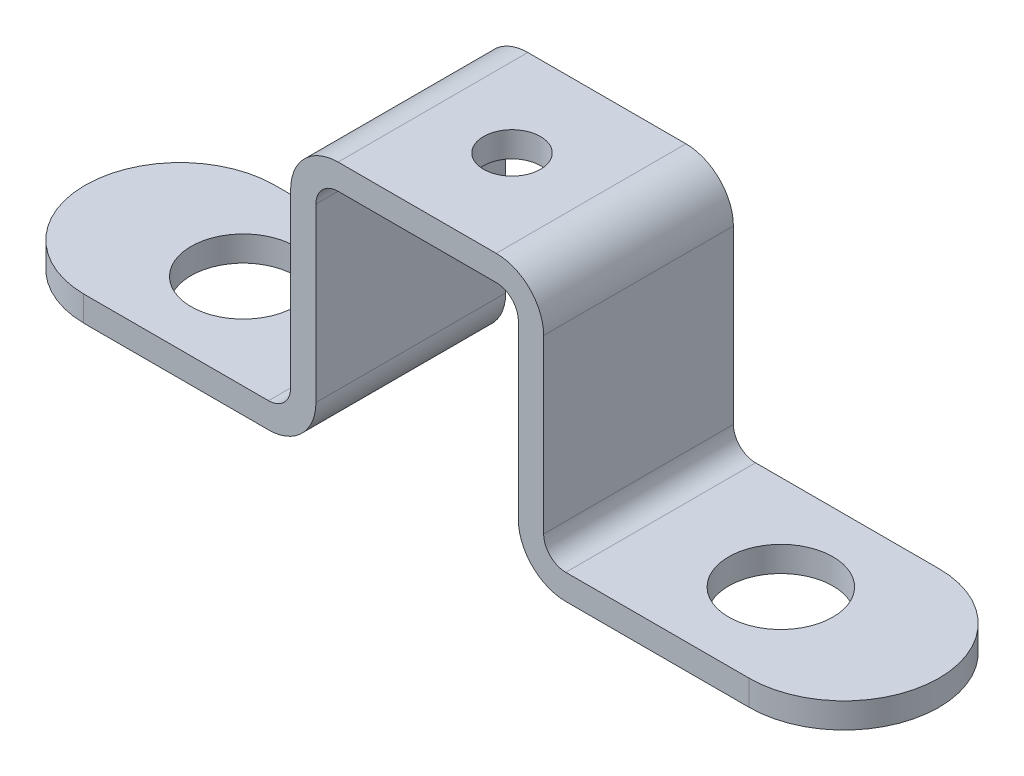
ISO-10303-21;
HEADER;
FILE_DESCRIPTION(('STEP AP214'),'2;1');
FILE_NAME('part.step','',(''),(''),'','','');
FILE_SCHEMA(('AUTOMOTIVE_DESIGN { 1 0 10303 214 1 1 1 1 }'));
ENDSEC;
DATA;
#1=APPLICATION_CONTEXT('core data for automotive mechanical design processes');
#2=APPLICATION_PROTOCOL_DEFINITION('international standard','automotive_design',2000,#1);
#3=PRODUCT_CONTEXT('',#1,'mechanical');
#4=PRODUCT('Part','Part','',(#3));
#5=PRODUCT_RELATED_PRODUCT_CATEGORY('part','',(#4));
#6=PRODUCT_DEFINITION_FORMATION('','',#4);
#7=PRODUCT_DEFINITION_CONTEXT('part definition',#1,'design');
#8=PRODUCT_DEFINITION('design','',#6,#7);
#9=PRODUCT_DEFINITION_SHAPE('','',#8);
#10=(LENGTH_UNIT() NAMED_UNIT(*) SI_UNIT(.MILLI.,.METRE.));
#11=(NAMED_UNIT(*) PLANE_ANGLE_UNIT() SI_UNIT($,.RADIAN.));
#12=(NAMED_UNIT(*) SI_UNIT($,.STERADIAN.) SOLID_ANGLE_UNIT());
#13=UNCERTAINTY_MEASURE_WITH_UNIT(LENGTH_MEASURE(1.E-05),#10,'distance_accuracy_value','');
#14=(GEOMETRIC_REPRESENTATION_CONTEXT(3) GLOBAL_UNCERTAINTY_ASSIGNED_CONTEXT((#13)) GLOBAL_UNIT_ASSIGNED_CONTEXT((#10,
#11,#12)) REPRESENTATION_CONTEXT('',''));
#15=CARTESIAN_POINT('',(0.,0.,0.));
#16=DIRECTION('',(0.,0.,1.));
#17=DIRECTION('',(1.,0.,0.));
#18=AXIS2_PLACEMENT_3D('',#15,#16,#17);
#19=CARTESIAN_POINT('',(-27.,1.6,12.));
#20=DIRECTION('',(0.,-1.,0.));
#21=DIRECTION('',(1.,0.,0.));
#22=AXIS2_PLACEMENT_3D('',#19,#20,#21);
#23=PLANE('',#22);
#24=CARTESIAN_POINT('',(-17.,1.6,6.));
#25=DIRECTION('',(0.,-1.,0.));
#26=DIRECTION('',(1.,0.,0.));
#27=AXIS2_PLACEMENT_3D('',#24,#25,#26);
#28=CIRCLE('',#27,3.3);
#29=CARTESIAN_POINT('',(-13.7,1.6,6.));
#30=VERTEX_POINT('',#29);
#31=EDGE_CURVE('E715',#30,#30,#28,.T.);
#32=ORIENTED_EDGE('',*,*,#31,.T.);
#33=EDGE_LOOP('',(#32));
#34=FACE_BOUND('',#33,.T.);
#35=CARTESIAN_POINT('',(-21.,1.6,6.));
#36=DIRECTION('',(0.,-1.,0.));
#37=DIRECTION('',(1.,0.,0.));
#38=AXIS2_PLACEMENT_3D('',#35,#36,#37);
#39=CIRCLE('',#38,6.00068260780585);
#40=CARTESIAN_POINT('',(-27.,1.6,5.90949165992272));
#41=VERTEX_POINT('',#40);
#42=CARTESIAN_POINT('',(-21.0905083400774,1.6,0.));
#43=VERTEX_POINT('',#42);
#44=EDGE_CURVE('E383',#41,#43,#39,.T.);
#45=ORIENTED_EDGE('',*,*,#44,.F.);
#46=DIRECTION('',(0.,0.,-1.));
#47=VECTOR('',#46,1.);
#48=CARTESIAN_POINT('',(-27.,1.6,12.));
#49=LINE('',#48,#47);
#50=CARTESIAN_POINT('',(-27.,1.6,6.09050834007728));
#51=VERTEX_POINT('',#50);
#52=EDGE_CURVE('E530',#51,#41,#49,.T.);
#53=ORIENTED_EDGE('',*,*,#52,.F.);
#54=CARTESIAN_POINT('',(-21.,1.6,6.));
#55=DIRECTION('',(0.,-1.,0.));
#56=DIRECTION('',(1.,0.,0.));
#57=AXIS2_PLACEMENT_3D('',#54,#55,#56);
#58=CIRCLE('',#57,6.00068260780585);
#59=CARTESIAN_POINT('',(-21.0905083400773,1.6,12.));
#60=VERTEX_POINT('',#59);
#61=EDGE_CURVE('E581',#60,#51,#58,.T.);
#62=ORIENTED_EDGE('',*,*,#61,.F.);
#63=DIRECTION('',(-1.,0.,0.));
#64=VECTOR('',#63,1.);
#65=CARTESIAN_POINT('',(-27.,1.6,12.));
#66=LINE('',#65,#64);
#67=CARTESIAN_POINT('',(-9.4,1.6,12.));
#68=VERTEX_POINT('',#67);
#69=EDGE_CURVE('E586',#68,#60,#66,.T.);
#70=ORIENTED_EDGE('',*,*,#69,.F.);
#71=DIRECTION('',(0.,0.,-1.));
#72=VECTOR('',#71,1.);
#73=CARTESIAN_POINT('',(-9.4,1.6,12.));
#74=LINE('',#73,#72);
#75=CARTESIAN_POINT('',(-9.4,1.6,0.));
#76=VERTEX_POINT('',#75);
#77=EDGE_CURVE('E536',#68,#76,#74,.T.);
#78=ORIENTED_EDGE('',*,*,#77,.T.);
#79=DIRECTION('',(-1.,0.,0.));
#80=VECTOR('',#79,1.);
#81=CARTESIAN_POINT('',(-27.,1.6,0.));
#82=LINE('',#81,#80);
#83=EDGE_CURVE('E687',#76,#43,#82,.T.);
#84=ORIENTED_EDGE('',*,*,#83,.T.);
#85=EDGE_LOOP('',(#45,#53,#62,#70,#78,#84));
#86=FACE_BOUND('',#85,.T.);
#87=ADVANCED_FACE('F368',(#34,#86),#23,.F.);
#88=CARTESIAN_POINT('',(-27.,0.,12.));
#89=DIRECTION('',(1.,0.,0.));
#90=DIRECTION('',(0.,0.,-1.));
#91=AXIS2_PLACEMENT_3D('',#88,#89,#90);
#92=PLANE('',#91);
#93=DIRECTION('',(0.,-1.,0.));
#94=VECTOR('',#93,1.);
#95=CARTESIAN_POINT('',(-27.,16.87,5.90949165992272));
#96=LINE('',#95,#94);
#97=CARTESIAN_POINT('',(-27.,0.,5.90949165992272));
#98=VERTEX_POINT('',#97);
#99=EDGE_CURVE('E517',#41,#98,#96,.T.);
#100=ORIENTED_EDGE('',*,*,#99,.T.);
#101=DIRECTION('',(0.,0.,-1.));
#102=VECTOR('',#101,1.);
#103=CARTESIAN_POINT('',(-27.,0.,12.));
#104=LINE('',#103,#102);
#105=CARTESIAN_POINT('',(-27.,0.,6.09050834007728));
#106=VERTEX_POINT('',#105);
#107=EDGE_CURVE('E528',#106,#98,#104,.T.);
#108=ORIENTED_EDGE('',*,*,#107,.F.);
#109=DIRECTION('',(0.,-1.,0.));
#110=VECTOR('',#109,1.);
#111=CARTESIAN_POINT('',(-27.,16.87,6.09050834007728));
#112=LINE('',#111,#110);
#113=EDGE_CURVE('E588',#51,#106,#112,.T.);
#114=ORIENTED_EDGE('',*,*,#113,.F.);
#115=ORIENTED_EDGE('',*,*,#52,.T.);
#116=EDGE_LOOP('',(#100,#108,#114,#115));
#117=FACE_BOUND('',#116,.T.);
#118=ADVANCED_FACE('F526',(#117),#92,.F.);
#119=CARTESIAN_POINT('',(-9.4,0.,12.));
#120=DIRECTION('',(0.,1.,0.));
#121=DIRECTION('',(0.,0.,1.));
#122=AXIS2_PLACEMENT_3D('',#119,#120,#121);
#123=PLANE('',#122);
#124=CARTESIAN_POINT('',(-17.,0.,6.));
#125=DIRECTION('',(0.,-1.,0.));
#126=DIRECTION('',(0.,0.,-1.));
#127=AXIS2_PLACEMENT_3D('',#124,#125,#126);
#128=CIRCLE('',#127,3.3);
#129=CARTESIAN_POINT('',(-17.,0.,2.7));
#130=VERTEX_POINT('',#129);
#131=EDGE_CURVE('E587',#130,#130,#128,.T.);
#132=ORIENTED_EDGE('',*,*,#131,.F.);
#133=EDGE_LOOP('',(#132));
#134=FACE_BOUND('',#133,.T.);
#135=CARTESIAN_POINT('',(-21.,0.,6.));
#136=DIRECTION('',(0.,-1.,0.));
#137=DIRECTION('',(0.,0.,-1.));
#138=AXIS2_PLACEMENT_3D('',#135,#136,#137);
#139=CIRCLE('',#138,6.00068260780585);
#140=CARTESIAN_POINT('',(-21.0905083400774,0.,0.));
#141=VERTEX_POINT('',#140);
#142=EDGE_CURVE('E514',#98,#141,#139,.T.);
#143=ORIENTED_EDGE('',*,*,#142,.T.);
#144=DIRECTION('',(1.,0.,0.));
#145=VECTOR('',#144,1.);
#146=CARTESIAN_POINT('',(-9.4,0.,0.));
#147=LINE('',#146,#145);
#148=CARTESIAN_POINT('',(-9.4,0.,0.));
#149=VERTEX_POINT('',#148);
#150=EDGE_CURVE('E647',#141,#149,#147,.T.);
#151=ORIENTED_EDGE('',*,*,#150,.T.);
#152=DIRECTION('',(0.,0.,-1.));
#153=VECTOR('',#152,1.);
#154=CARTESIAN_POINT('',(-9.4,0.,12.));
#155=LINE('',#154,#153);
#156=CARTESIAN_POINT('',(-9.4,0.,12.));
#157=VERTEX_POINT('',#156);
#158=EDGE_CURVE('E534',#157,#149,#155,.T.);
#159=ORIENTED_EDGE('',*,*,#158,.F.);
#160=DIRECTION('',(1.,0.,0.));
#161=VECTOR('',#160,1.);
#162=CARTESIAN_POINT('',(-9.4,0.,12.));
#163=LINE('',#162,#161);
#164=CARTESIAN_POINT('',(-21.0905083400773,0.,12.));
#165=VERTEX_POINT('',#164);
#166=EDGE_CURVE('E594',#165,#157,#163,.T.);
#167=ORIENTED_EDGE('',*,*,#166,.F.);
#168=CARTESIAN_POINT('',(-21.,0.,6.));
#169=DIRECTION('',(0.,-1.,0.));
#170=DIRECTION('',(0.,0.,-1.));
#171=AXIS2_PLACEMENT_3D('',#168,#169,#170);
#172=CIRCLE('',#171,6.00068260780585);
#173=EDGE_CURVE('E390',#165,#106,#172,.T.);
#174=ORIENTED_EDGE('',*,*,#173,.T.);
#175=ORIENTED_EDGE('',*,*,#107,.T.);
#176=EDGE_LOOP('',(#143,#151,#159,#167,#174,#175));
#177=FACE_BOUND('',#176,.T.);
#178=ADVANCED_FACE('F532',(#134,#177),#123,.F.);
#179=CARTESIAN_POINT('',(9.4,3.,0.));
#180=DIRECTION('',(0.,0.,-1.));
#181=DIRECTION('',(-1.,0.,0.));
#182=AXIS2_PLACEMENT_3D('',#179,#180,#181);
#183=PLANE('',#182);
#184=ORIENTED_EDGE('',*,*,#150,.F.);
#185=DIRECTION('',(0.,-1.,0.));
#186=VECTOR('',#185,1.);
#187=CARTESIAN_POINT('',(-21.0905083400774,16.87,0.));
#188=LINE('',#187,#186);
#189=EDGE_CURVE('E12',#141,#43,#188,.F.);
#190=ORIENTED_EDGE('',*,*,#189,.T.);
#191=ORIENTED_EDGE('',*,*,#83,.F.);
#192=CARTESIAN_POINT('',(-9.4,3.,0.));
#193=DIRECTION('',(0.,0.,-1.));
#194=DIRECTION('',(1.,0.,0.));
#195=AXIS2_PLACEMENT_3D('',#192,#193,#194);
#196=CIRCLE('',#195,1.4);
#197=CARTESIAN_POINT('',(-8.,3.,0.));
#198=VERTEX_POINT('',#197);
#199=EDGE_CURVE('E684',#198,#76,#196,.T.);
#200=ORIENTED_EDGE('',*,*,#199,.F.);
#201=DIRECTION('',(0.,-1.,0.));
#202=VECTOR('',#201,1.);
#203=CARTESIAN_POINT('',(-8.,3.,0.));
#204=LINE('',#203,#202);
#205=CARTESIAN_POINT('',(-8.,13.87,0.));
#206=VERTEX_POINT('',#205);
#207=EDGE_CURVE('E680',#206,#198,#204,.T.);
#208=ORIENTED_EDGE('',*,*,#207,.F.);
#209=CARTESIAN_POINT('',(-5.,13.87,0.));
#210=DIRECTION('',(0.,0.,1.));
#211=DIRECTION('',(-1.,0.,0.));
#212=AXIS2_PLACEMENT_3D('',#209,#210,#211);
#213=CIRCLE('',#212,3.);
#214=CARTESIAN_POINT('',(-5.00000000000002,16.87,0.));
#215=VERTEX_POINT('',#214);
#216=EDGE_CURVE('E692',#215,#206,#213,.T.);
#217=ORIENTED_EDGE('',*,*,#216,.F.);
#218=DIRECTION('',(-1.,0.,0.));
#219=VECTOR('',#218,1.);
#220=CARTESIAN_POINT('',(5.00000000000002,16.87,0.));
#221=LINE('',#220,#219);
#222=CARTESIAN_POINT('',(5.00000000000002,16.87,0.));
#223=VERTEX_POINT('',#222);
#224=EDGE_CURVE('E694',#223,#215,#221,.T.);
#225=ORIENTED_EDGE('',*,*,#224,.F.);
#226=CARTESIAN_POINT('',(5.,13.87,0.));
#227=DIRECTION('',(0.,0.,1.));
#228=DIRECTION('',(1.,0.,0.));
#229=AXIS2_PLACEMENT_3D('',#226,#227,#228);
#230=CIRCLE('',#229,3.);
#231=CARTESIAN_POINT('',(8.,13.87,0.));
#232=VERTEX_POINT('',#231);
#233=EDGE_CURVE('E696',#232,#223,#230,.T.);
#234=ORIENTED_EDGE('',*,*,#233,.F.);
#235=DIRECTION('',(0.,1.,0.));
#236=VECTOR('',#235,1.);
#237=CARTESIAN_POINT('',(8.,3.,0.));
#238=LINE('',#237,#236);
#239=CARTESIAN_POINT('',(8.,3.,0.));
#240=VERTEX_POINT('',#239);
#241=EDGE_CURVE('E698',#240,#232,#238,.T.);
#242=ORIENTED_EDGE('',*,*,#241,.F.);
#243=CARTESIAN_POINT('',(9.4,3.,0.));
#244=DIRECTION('',(0.,0.,-1.));
#245=DIRECTION('',(-1.,0.,0.));
#246=AXIS2_PLACEMENT_3D('',#243,#244,#245);
#247=CIRCLE('',#246,1.4);
#248=CARTESIAN_POINT('',(9.4,1.6,0.));
#249=VERTEX_POINT('',#248);
#250=EDGE_CURVE('E700',#249,#240,#247,.T.);
#251=ORIENTED_EDGE('',*,*,#250,.F.);
#252=DIRECTION('',(-1.,0.,0.));
#253=VECTOR('',#252,1.);
#254=CARTESIAN_POINT('',(27.,1.6,0.));
#255=LINE('',#254,#253);
#256=CARTESIAN_POINT('',(21.,1.6,0.));
#257=VERTEX_POINT('',#256);
#258=EDGE_CURVE('E702',#257,#249,#255,.T.);
#259=ORIENTED_EDGE('',*,*,#258,.F.);
#260=DIRECTION('',(0.,-1.,0.));
#261=VECTOR('',#260,1.);
#262=CARTESIAN_POINT('',(21.,16.87,0.));
#263=LINE('',#262,#261);
#264=CARTESIAN_POINT('',(21.,0.,0.));
#265=VERTEX_POINT('',#264);
#266=EDGE_CURVE('E572',#265,#257,#263,.F.);
#267=ORIENTED_EDGE('',*,*,#266,.F.);
#268=DIRECTION('',(1.,0.,0.));
#269=VECTOR('',#268,1.);
#270=CARTESIAN_POINT('',(9.4,0.,0.));
#271=LINE('',#270,#269);
#272=CARTESIAN_POINT('',(9.4,0.,0.));
#273=VERTEX_POINT('',#272);
#274=EDGE_CURVE('E704',#273,#265,#271,.T.);
#275=ORIENTED_EDGE('',*,*,#274,.F.);
#276=CARTESIAN_POINT('',(9.4,3.,0.));
#277=DIRECTION('',(0.,0.,1.));
#278=DIRECTION('',(-1.,0.,0.));
#279=AXIS2_PLACEMENT_3D('',#276,#277,#278);
#280=CIRCLE('',#279,3.);
#281=CARTESIAN_POINT('',(6.4,3.00000000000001,0.));
#282=VERTEX_POINT('',#281);
#283=EDGE_CURVE('E707',#282,#273,#280,.T.);
#284=ORIENTED_EDGE('',*,*,#283,.F.);
#285=DIRECTION('',(0.,-1.,0.));
#286=VECTOR('',#285,1.);
#287=CARTESIAN_POINT('',(6.4,3.00000000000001,0.));
#288=LINE('',#287,#286);
#289=CARTESIAN_POINT('',(6.39999999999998,13.87,0.));
#290=VERTEX_POINT('',#289);
#291=EDGE_CURVE('E654',#290,#282,#288,.T.);
#292=ORIENTED_EDGE('',*,*,#291,.F.);
#293=CARTESIAN_POINT('',(5.,13.87,0.));
#294=DIRECTION('',(0.,0.,-1.));
#295=DIRECTION('',(1.,0.,0.));
#296=AXIS2_PLACEMENT_3D('',#293,#294,#295);
#297=CIRCLE('',#296,1.39999999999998);
#298=CARTESIAN_POINT('',(5.,15.27,0.));
#299=VERTEX_POINT('',#298);
#300=EDGE_CURVE('E652',#299,#290,#297,.T.);
#301=ORIENTED_EDGE('',*,*,#300,.F.);
#302=DIRECTION('',(1.,0.,0.));
#303=VECTOR('',#302,1.);
#304=CARTESIAN_POINT('',(5.,15.27,0.));
#305=LINE('',#304,#303);
#306=CARTESIAN_POINT('',(-5.,15.27,0.));
#307=VERTEX_POINT('',#306);
#308=EDGE_CURVE('E645',#307,#299,#305,.T.);
#309=ORIENTED_EDGE('',*,*,#308,.F.);
#310=CARTESIAN_POINT('',(-5.,13.87,0.));
#311=DIRECTION('',(0.,0.,-1.));
#312=DIRECTION('',(-1.,0.,0.));
#313=AXIS2_PLACEMENT_3D('',#310,#311,#312);
#314=CIRCLE('',#313,1.39999999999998);
#315=CARTESIAN_POINT('',(-6.39999999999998,13.87,0.));
#316=VERTEX_POINT('',#315);
#317=EDGE_CURVE('E643',#316,#307,#314,.T.);
#318=ORIENTED_EDGE('',*,*,#317,.F.);
#319=DIRECTION('',(0.,1.,0.));
#320=VECTOR('',#319,1.);
#321=CARTESIAN_POINT('',(-6.4,3.00000000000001,0.));
#322=LINE('',#321,#320);
#323=CARTESIAN_POINT('',(-6.4,3.00000000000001,0.));
#324=VERTEX_POINT('',#323);
#325=EDGE_CURVE('E634',#324,#316,#322,.T.);
#326=ORIENTED_EDGE('',*,*,#325,.F.);
#327=CARTESIAN_POINT('',(-9.4,3.,0.));
#328=DIRECTION('',(0.,0.,1.));
#329=DIRECTION('',(1.,0.,0.));
#330=AXIS2_PLACEMENT_3D('',#327,#328,#329);
#331=CIRCLE('',#330,3.);
#332=EDGE_CURVE('E641',#149,#324,#331,.T.);
#333=ORIENTED_EDGE('',*,*,#332,.F.);
#334=EDGE_LOOP('',(#184,#190,#191,#200,#208,#217,#225,#234,#242,#251,#259,#267,#275,#284,#292,
#301,#309,#318,#326,#333));
#335=FACE_BOUND('',#334,.T.);
#336=ADVANCED_FACE('F640',(#335),#183,.T.);
#337=CARTESIAN_POINT('',(9.4,3.,12.));
#338=DIRECTION('',(0.,0.,-1.));
#339=DIRECTION('',(-1.,0.,0.));
#340=AXIS2_PLACEMENT_3D('',#337,#338,#339);
#341=PLANE('',#340);
#342=DIRECTION('',(0.,-1.,0.));
#343=VECTOR('',#342,1.);
#344=CARTESIAN_POINT('',(-21.0905083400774,16.87,12.));
#345=LINE('',#344,#343);
#346=EDGE_CURVE('E376',#165,#60,#345,.F.);
#347=ORIENTED_EDGE('',*,*,#346,.F.);
#348=ORIENTED_EDGE('',*,*,#166,.T.);
#349=CARTESIAN_POINT('',(-9.4,3.,12.));
#350=DIRECTION('',(0.,0.,1.));
#351=DIRECTION('',(1.,0.,0.));
#352=AXIS2_PLACEMENT_3D('',#349,#350,#351);
#353=CIRCLE('',#352,3.);
#354=CARTESIAN_POINT('',(-6.4,3.00000000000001,12.));
#355=VERTEX_POINT('',#354);
#356=EDGE_CURVE('E596',#157,#355,#353,.T.);
#357=ORIENTED_EDGE('',*,*,#356,.T.);
#358=DIRECTION('',(0.,1.,0.));
#359=VECTOR('',#358,1.);
#360=CARTESIAN_POINT('',(-6.4,3.00000000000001,12.));
#361=LINE('',#360,#359);
#362=CARTESIAN_POINT('',(-6.39999999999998,13.87,12.));
#363=VERTEX_POINT('',#362);
#364=EDGE_CURVE('E603',#355,#363,#361,.T.);
#365=ORIENTED_EDGE('',*,*,#364,.T.);
#366=CARTESIAN_POINT('',(-5.,13.87,12.));
#367=DIRECTION('',(0.,0.,-1.));
#368=DIRECTION('',(-1.,0.,0.));
#369=AXIS2_PLACEMENT_3D('',#366,#367,#368);
#370=CIRCLE('',#369,1.39999999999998);
#371=CARTESIAN_POINT('',(-5.,15.27,12.));
#372=VERTEX_POINT('',#371);
#373=EDGE_CURVE('E605',#363,#372,#370,.T.);
#374=ORIENTED_EDGE('',*,*,#373,.T.);
#375=DIRECTION('',(1.,0.,0.));
#376=VECTOR('',#375,1.);
#377=CARTESIAN_POINT('',(5.,15.27,12.));
#378=LINE('',#377,#376);
#379=CARTESIAN_POINT('',(5.,15.27,12.));
#380=VERTEX_POINT('',#379);
#381=EDGE_CURVE('E607',#372,#380,#378,.T.);
#382=ORIENTED_EDGE('',*,*,#381,.T.);
#383=CARTESIAN_POINT('',(5.,13.87,12.));
#384=DIRECTION('',(0.,0.,-1.));
#385=DIRECTION('',(1.,0.,0.));
#386=AXIS2_PLACEMENT_3D('',#383,#384,#385);
#387=CIRCLE('',#386,1.39999999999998);
#388=CARTESIAN_POINT('',(6.39999999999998,13.87,12.));
#389=VERTEX_POINT('',#388);
#390=EDGE_CURVE('E609',#380,#389,#387,.T.);
#391=ORIENTED_EDGE('',*,*,#390,.T.);
#392=DIRECTION('',(0.,-1.,0.));
#393=VECTOR('',#392,1.);
#394=CARTESIAN_POINT('',(6.4,3.00000000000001,12.));
#395=LINE('',#394,#393);
#396=CARTESIAN_POINT('',(6.4,3.00000000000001,12.));
#397=VERTEX_POINT('',#396);
#398=EDGE_CURVE('E611',#389,#397,#395,.T.);
#399=ORIENTED_EDGE('',*,*,#398,.T.);
#400=CARTESIAN_POINT('',(9.4,3.,12.));
#401=DIRECTION('',(0.,0.,1.));
#402=DIRECTION('',(-1.,0.,0.));
#403=AXIS2_PLACEMENT_3D('',#400,#401,#402);
#404=CIRCLE('',#403,3.);
#405=CARTESIAN_POINT('',(9.4,0.,12.));
#406=VERTEX_POINT('',#405);
#407=EDGE_CURVE('E656',#397,#406,#404,.T.);
#408=ORIENTED_EDGE('',*,*,#407,.T.);
#409=DIRECTION('',(1.,0.,0.));
#410=VECTOR('',#409,1.);
#411=CARTESIAN_POINT('',(9.4,0.,12.));
#412=LINE('',#411,#410);
#413=CARTESIAN_POINT('',(21.,0.,12.));
#414=VERTEX_POINT('',#413);
#415=EDGE_CURVE('E659',#406,#414,#412,.T.);
#416=ORIENTED_EDGE('',*,*,#415,.T.);
#417=DIRECTION('',(0.,-1.,0.));
#418=VECTOR('',#417,1.);
#419=CARTESIAN_POINT('',(21.,16.87,12.));
#420=LINE('',#419,#418);
#421=CARTESIAN_POINT('',(21.,1.6,12.));
#422=VERTEX_POINT('',#421);
#423=EDGE_CURVE('E569',#414,#422,#420,.F.);
#424=ORIENTED_EDGE('',*,*,#423,.T.);
#425=DIRECTION('',(-1.,0.,0.));
#426=VECTOR('',#425,1.);
#427=CARTESIAN_POINT('',(27.,1.6,12.));
#428=LINE('',#427,#426);
#429=CARTESIAN_POINT('',(9.4,1.6,12.));
#430=VERTEX_POINT('',#429);
#431=EDGE_CURVE('E662',#422,#430,#428,.T.);
#432=ORIENTED_EDGE('',*,*,#431,.T.);
#433=CARTESIAN_POINT('',(9.4,3.,12.));
#434=DIRECTION('',(0.,0.,-1.));
#435=DIRECTION('',(-1.,0.,0.));
#436=AXIS2_PLACEMENT_3D('',#433,#434,#435);
#437=CIRCLE('',#436,1.4);
#438=CARTESIAN_POINT('',(8.,3.,12.));
#439=VERTEX_POINT('',#438);
#440=EDGE_CURVE('E664',#430,#439,#437,.T.);
#441=ORIENTED_EDGE('',*,*,#440,.T.);
#442=DIRECTION('',(0.,1.,0.));
#443=VECTOR('',#442,1.);
#444=CARTESIAN_POINT('',(8.,3.,12.));
#445=LINE('',#444,#443);
#446=CARTESIAN_POINT('',(8.,13.87,12.));
#447=VERTEX_POINT('',#446);
#448=EDGE_CURVE('E666',#439,#447,#445,.T.);
#449=ORIENTED_EDGE('',*,*,#448,.T.);
#450=CARTESIAN_POINT('',(5.,13.87,12.));
#451=DIRECTION('',(0.,0.,1.));
#452=DIRECTION('',(1.,0.,0.));
#453=AXIS2_PLACEMENT_3D('',#450,#451,#452);
#454=CIRCLE('',#453,3.);
#455=CARTESIAN_POINT('',(5.00000000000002,16.87,12.));
#456=VERTEX_POINT('',#455);
#457=EDGE_CURVE('E668',#447,#456,#454,.T.);
#458=ORIENTED_EDGE('',*,*,#457,.T.);
#459=DIRECTION('',(-1.,0.,0.));
#460=VECTOR('',#459,1.);
#461=CARTESIAN_POINT('',(5.00000000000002,16.87,12.));
#462=LINE('',#461,#460);
#463=CARTESIAN_POINT('',(-5.00000000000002,16.87,12.));
#464=VERTEX_POINT('',#463);
#465=EDGE_CURVE('E670',#456,#464,#462,.T.);
#466=ORIENTED_EDGE('',*,*,#465,.T.);
#467=CARTESIAN_POINT('',(-5.,13.87,12.));
#468=DIRECTION('',(0.,0.,1.));
#469=DIRECTION('',(-1.,0.,0.));
#470=AXIS2_PLACEMENT_3D('',#467,#468,#469);
#471=CIRCLE('',#470,3.);
#472=CARTESIAN_POINT('',(-8.,13.87,12.));
#473=VERTEX_POINT('',#472);
#474=EDGE_CURVE('E672',#464,#473,#471,.T.);
#475=ORIENTED_EDGE('',*,*,#474,.T.);
#476=DIRECTION('',(0.,-1.,0.));
#477=VECTOR('',#476,1.);
#478=CARTESIAN_POINT('',(-8.,3.,12.));
#479=LINE('',#478,#477);
#480=CARTESIAN_POINT('',(-8.,3.,12.));
#481=VERTEX_POINT('',#480);
#482=EDGE_CURVE('E598',#473,#481,#479,.T.);
#483=ORIENTED_EDGE('',*,*,#482,.T.);
#484=CARTESIAN_POINT('',(-9.4,3.,12.));
#485=DIRECTION('',(0.,0.,-1.));
#486=DIRECTION('',(1.,0.,0.));
#487=AXIS2_PLACEMENT_3D('',#484,#485,#486);
#488=CIRCLE('',#487,1.4);
#489=EDGE_CURVE('E592',#481,#68,#488,.T.);
#490=ORIENTED_EDGE('',*,*,#489,.T.);
#491=ORIENTED_EDGE('',*,*,#69,.T.);
#492=EDGE_LOOP('',(#347,#348,#357,#365,#374,#382,#391,#399,#408,#416,#424,#432,#441,#449,#458,
#466,#475,#483,#490,#491));
#493=FACE_BOUND('',#492,.T.);
#494=ADVANCED_FACE('F590',(#493),#341,.F.);
#495=CARTESIAN_POINT('',(9.4,0.,12.));
#496=DIRECTION('',(0.,1.,0.));
#497=DIRECTION('',(0.,0.,1.));
#498=AXIS2_PLACEMENT_3D('',#495,#496,#497);
#499=PLANE('',#498);
#500=ORIENTED_EDGE('',*,*,#274,.T.);
#501=CARTESIAN_POINT('',(21.,0.,6.));
#502=DIRECTION('',(0.,1.,0.));
#503=DIRECTION('',(0.,0.,1.));
#504=AXIS2_PLACEMENT_3D('',#501,#502,#503);
#505=CIRCLE('',#504,6.);
#506=EDGE_CURVE('E577',#414,#265,#505,.T.);
#507=ORIENTED_EDGE('',*,*,#506,.F.);
#508=ORIENTED_EDGE('',*,*,#415,.F.);
#509=DIRECTION('',(0.,0.,-1.));
#510=VECTOR('',#509,1.);
#511=CARTESIAN_POINT('',(9.4,0.,12.));
#512=LINE('',#511,#510);
#513=EDGE_CURVE('E566',#406,#273,#512,.T.);
#514=ORIENTED_EDGE('',*,*,#513,.T.);
#515=EDGE_LOOP('',(#500,#507,#508,#514));
#516=FACE_BOUND('',#515,.T.);
#517=CARTESIAN_POINT('',(17.,0.,6.));
#518=DIRECTION('',(0.,1.,0.));
#519=DIRECTION('',(0.,0.,1.));
#520=AXIS2_PLACEMENT_3D('',#517,#518,#519);
#521=CIRCLE('',#520,3.3);
#522=CARTESIAN_POINT('',(17.,0.,9.3));
#523=VERTEX_POINT('',#522);
#524=EDGE_CURVE('E578',#523,#523,#521,.T.);
#525=ORIENTED_EDGE('',*,*,#524,.T.);
#526=EDGE_LOOP('',(#525));
#527=FACE_BOUND('',#526,.T.);
#528=ADVANCED_FACE('F799',(#516,#527),#499,.F.);
#529=CARTESIAN_POINT('',(27.,1.6,12.));
#530=DIRECTION('',(0.,-1.,0.));
#531=DIRECTION('',(1.,0.,0.));
#532=AXIS2_PLACEMENT_3D('',#529,#530,#531);
#533=PLANE('',#532);
#534=CARTESIAN_POINT('',(21.,1.6,6.));
#535=DIRECTION('',(0.,-1.,0.));
#536=DIRECTION('',(1.,0.,0.));
#537=AXIS2_PLACEMENT_3D('',#534,#535,#536);
#538=CIRCLE('',#537,6.);
#539=EDGE_CURVE('E710',#422,#257,#538,.F.);
#540=ORIENTED_EDGE('',*,*,#539,.T.);
#541=ORIENTED_EDGE('',*,*,#258,.T.);
#542=DIRECTION('',(0.,0.,-1.));
#543=VECTOR('',#542,1.);
#544=CARTESIAN_POINT('',(9.4,1.6,12.));
#545=LINE('',#544,#543);
#546=EDGE_CURVE('E563',#430,#249,#545,.T.);
#547=ORIENTED_EDGE('',*,*,#546,.F.);
#548=ORIENTED_EDGE('',*,*,#431,.F.);
#549=EDGE_LOOP('',(#540,#541,#547,#548));
#550=FACE_BOUND('',#549,.T.);
#551=CARTESIAN_POINT('',(17.,1.6,6.));
#552=DIRECTION('',(0.,-1.,0.));
#553=DIRECTION('',(1.,0.,0.));
#554=AXIS2_PLACEMENT_3D('',#551,#552,#553);
#555=CIRCLE('',#554,3.3);
#556=CARTESIAN_POINT('',(20.3,1.6,6.));
#557=VERTEX_POINT('',#556);
#558=EDGE_CURVE('E575',#557,#557,#555,.F.);
#559=ORIENTED_EDGE('',*,*,#558,.F.);
#560=EDGE_LOOP('',(#559));
#561=FACE_BOUND('',#560,.T.);
#562=ADVANCED_FACE('F797',(#550,#561),#533,.F.);
#563=CARTESIAN_POINT('',(9.4,3.,12.));
#564=DIRECTION('',(0.,0.,-1.));
#565=DIRECTION('',(-1.,0.,0.));
#566=AXIS2_PLACEMENT_3D('',#563,#564,#565);
#567=CYLINDRICAL_SURFACE('',#566,3.);
#568=ORIENTED_EDGE('',*,*,#283,.T.);
#569=ORIENTED_EDGE('',*,*,#513,.F.);
#570=ORIENTED_EDGE('',*,*,#407,.F.);
#571=DIRECTION('',(0.,0.,-1.));
#572=VECTOR('',#571,1.);
#573=CARTESIAN_POINT('',(6.4,3.00000000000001,12.));
#574=LINE('',#573,#572);
#575=EDGE_CURVE('E613',#397,#282,#574,.T.);
#576=ORIENTED_EDGE('',*,*,#575,.T.);
#577=EDGE_LOOP('',(#568,#569,#570,#576));
#578=FACE_BOUND('',#577,.T.);
#579=ADVANCED_FACE('F370',(#578),#567,.T.);
#580=CARTESIAN_POINT('',(9.4,3.,12.));
#581=DIRECTION('',(0.,0.,-1.));
#582=DIRECTION('',(-1.,0.,0.));
#583=AXIS2_PLACEMENT_3D('',#580,#581,#582);
#584=CYLINDRICAL_SURFACE('',#583,1.4);
#585=ORIENTED_EDGE('',*,*,#250,.T.);
#586=DIRECTION('',(0.,0.,-1.));
#587=VECTOR('',#586,1.);
#588=CARTESIAN_POINT('',(8.,3.,12.));
#589=LINE('',#588,#587);
#590=EDGE_CURVE('E560',#439,#240,#589,.T.);
#591=ORIENTED_EDGE('',*,*,#590,.F.);
#592=ORIENTED_EDGE('',*,*,#440,.F.);
#593=ORIENTED_EDGE('',*,*,#546,.T.);
#594=EDGE_LOOP('',(#585,#591,#592,#593));
#595=FACE_BOUND('',#594,.T.);
#596=ADVANCED_FACE('F792',(#595),#584,.F.);
#597=CARTESIAN_POINT('',(8.,3.,12.));
#598=DIRECTION('',(-1.,0.,0.));
#599=DIRECTION('',(0.,0.,1.));
#600=AXIS2_PLACEMENT_3D('',#597,#598,#599);
#601=PLANE('',#600);
#602=ORIENTED_EDGE('',*,*,#241,.T.);
#603=DIRECTION('',(0.,0.,-1.));
#604=VECTOR('',#603,1.);
#605=CARTESIAN_POINT('',(8.,13.87,12.));
#606=LINE('',#605,#604);
#607=EDGE_CURVE('E557',#447,#232,#606,.T.);
#608=ORIENTED_EDGE('',*,*,#607,.F.);
#609=ORIENTED_EDGE('',*,*,#448,.F.);
#610=ORIENTED_EDGE('',*,*,#590,.T.);
#611=EDGE_LOOP('',(#602,#608,#609,#610));
#612=FACE_BOUND('',#611,.T.);
#613=ADVANCED_FACE('F788',(#612),#601,.F.);
#614=CARTESIAN_POINT('',(5.,13.87,12.));
#615=DIRECTION('',(0.,0.,-1.));
#616=DIRECTION('',(-1.,0.,0.));
#617=AXIS2_PLACEMENT_3D('',#614,#615,#616);
#618=CYLINDRICAL_SURFACE('',#617,3.);
#619=ORIENTED_EDGE('',*,*,#233,.T.);
#620=DIRECTION('',(0.,0.,-1.));
#621=VECTOR('',#620,1.);
#622=CARTESIAN_POINT('',(5.00000000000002,16.87,12.));
#623=LINE('',#622,#621);
#624=EDGE_CURVE('E554',#456,#223,#623,.T.);
#625=ORIENTED_EDGE('',*,*,#624,.F.);
#626=ORIENTED_EDGE('',*,*,#457,.F.);
#627=ORIENTED_EDGE('',*,*,#607,.T.);
#628=EDGE_LOOP('',(#619,#625,#626,#627));
#629=FACE_BOUND('',#628,.T.);
#630=ADVANCED_FACE('F784',(#629),#618,.T.);
#631=CARTESIAN_POINT('',(5.00000000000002,16.87,12.));
#632=DIRECTION('',(0.,-1.,0.));
#633=DIRECTION('',(0.,0.,-1.));
#634=AXIS2_PLACEMENT_3D('',#631,#632,#633);
#635=PLANE('',#634);
#636=CARTESIAN_POINT('',(0.,16.87,6.));
#637=DIRECTION('',(0.,-1.,0.));
#638=DIRECTION('',(0.,0.,-1.));
#639=AXIS2_PLACEMENT_3D('',#636,#637,#638);
#640=CIRCLE('',#639,1.8);
#641=CARTESIAN_POINT('',(0.,16.87,4.2));
#642=VERTEX_POINT('',#641);
#643=EDGE_CURVE('E521',#642,#642,#640,.T.);
#644=ORIENTED_EDGE('',*,*,#643,.T.);
#645=EDGE_LOOP('',(#644));
#646=FACE_BOUND('',#645,.T.);
#647=ORIENTED_EDGE('',*,*,#224,.T.);
#648=DIRECTION('',(0.,0.,-1.));
#649=VECTOR('',#648,1.);
#650=CARTESIAN_POINT('',(-5.00000000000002,16.87,12.));
#651=LINE('',#650,#649);
#652=EDGE_CURVE('E551',#464,#215,#651,.T.);
#653=ORIENTED_EDGE('',*,*,#652,.F.);
#654=ORIENTED_EDGE('',*,*,#465,.F.);
#655=ORIENTED_EDGE('',*,*,#624,.T.);
#656=EDGE_LOOP('',(#647,#653,#654,#655));
#657=FACE_BOUND('',#656,.T.);
#658=ADVANCED_FACE('F780',(#646,#657),#635,.F.);
#659=CARTESIAN_POINT('',(-5.,13.87,12.));
#660=DIRECTION('',(0.,0.,-1.));
#661=DIRECTION('',(-1.,0.,0.));
#662=AXIS2_PLACEMENT_3D('',#659,#660,#661);
#663=CYLINDRICAL_SURFACE('',#662,3.);
#664=ORIENTED_EDGE('',*,*,#216,.T.);
#665=DIRECTION('',(0.,0.,-1.));
#666=VECTOR('',#665,1.);
#667=CARTESIAN_POINT('',(-8.,13.87,12.));
#668=LINE('',#667,#666);
#669=EDGE_CURVE('E548',#473,#206,#668,.T.);
#670=ORIENTED_EDGE('',*,*,#669,.F.);
#671=ORIENTED_EDGE('',*,*,#474,.F.);
#672=ORIENTED_EDGE('',*,*,#652,.T.);
#673=EDGE_LOOP('',(#664,#670,#671,#672));
#674=FACE_BOUND('',#673,.T.);
#675=ADVANCED_FACE('F777',(#674),#663,.T.);
#676=CARTESIAN_POINT('',(-8.,3.,12.));
#677=DIRECTION('',(1.,0.,0.));
#678=DIRECTION('',(0.,0.,-1.));
#679=AXIS2_PLACEMENT_3D('',#676,#677,#678);
#680=PLANE('',#679);
#681=ORIENTED_EDGE('',*,*,#207,.T.);
#682=DIRECTION('',(0.,0.,-1.));
#683=VECTOR('',#682,1.);
#684=CARTESIAN_POINT('',(-8.,3.,12.));
#685=LINE('',#684,#683);
#686=EDGE_CURVE('E545',#481,#198,#685,.T.);
#687=ORIENTED_EDGE('',*,*,#686,.F.);
#688=ORIENTED_EDGE('',*,*,#482,.F.);
#689=ORIENTED_EDGE('',*,*,#669,.T.);
#690=EDGE_LOOP('',(#681,#687,#688,#689));
#691=FACE_BOUND('',#690,.T.);
#692=ADVANCED_FACE('F678',(#691),#680,.F.);
#693=CARTESIAN_POINT('',(-9.4,3.,12.));
#694=DIRECTION('',(0.,0.,-1.));
#695=DIRECTION('',(-1.,0.,0.));
#696=AXIS2_PLACEMENT_3D('',#693,#694,#695);
#697=CYLINDRICAL_SURFACE('',#696,1.4);
#698=ORIENTED_EDGE('',*,*,#199,.T.);
#699=ORIENTED_EDGE('',*,*,#77,.F.);
#700=ORIENTED_EDGE('',*,*,#489,.F.);
#701=ORIENTED_EDGE('',*,*,#686,.T.);
#702=EDGE_LOOP('',(#698,#699,#700,#701));
#703=FACE_BOUND('',#702,.T.);
#704=ADVANCED_FACE('F683',(#703),#697,.F.);
#705=CARTESIAN_POINT('',(-9.4,3.,12.));
#706=DIRECTION('',(0.,0.,-1.));
#707=DIRECTION('',(-1.,0.,0.));
#708=AXIS2_PLACEMENT_3D('',#705,#706,#707);
#709=CYLINDRICAL_SURFACE('',#708,3.);
#710=ORIENTED_EDGE('',*,*,#332,.T.);
#711=DIRECTION('',(0.,0.,-1.));
#712=VECTOR('',#711,1.);
#713=CARTESIAN_POINT('',(-6.4,3.00000000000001,12.));
#714=LINE('',#713,#712);
#715=EDGE_CURVE('E539',#355,#324,#714,.T.);
#716=ORIENTED_EDGE('',*,*,#715,.F.);
#717=ORIENTED_EDGE('',*,*,#356,.F.);
#718=ORIENTED_EDGE('',*,*,#158,.T.);
#719=EDGE_LOOP('',(#710,#716,#717,#718));
#720=FACE_BOUND('',#719,.T.);
#721=ADVANCED_FACE('F761',(#720),#709,.T.);
#722=CARTESIAN_POINT('',(-6.4,3.00000000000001,12.));
#723=DIRECTION('',(-1.,0.,0.));
#724=DIRECTION('',(0.,-1.,0.));
#725=AXIS2_PLACEMENT_3D('',#722,#723,#724);
#726=PLANE('',#725);
#727=ORIENTED_EDGE('',*,*,#325,.T.);
#728=DIRECTION('',(0.,0.,-1.));
#729=VECTOR('',#728,1.);
#730=CARTESIAN_POINT('',(-6.39999999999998,13.87,12.));
#731=LINE('',#730,#729);
#732=EDGE_CURVE('E625',#363,#316,#731,.T.);
#733=ORIENTED_EDGE('',*,*,#732,.F.);
#734=ORIENTED_EDGE('',*,*,#364,.F.);
#735=ORIENTED_EDGE('',*,*,#715,.T.);
#736=EDGE_LOOP('',(#727,#733,#734,#735));
#737=FACE_BOUND('',#736,.T.);
#738=ADVANCED_FACE('F632',(#737),#726,.F.);
#739=CARTESIAN_POINT('',(-5.,13.87,12.));
#740=DIRECTION('',(0.,0.,-1.));
#741=DIRECTION('',(-1.,0.,0.));
#742=AXIS2_PLACEMENT_3D('',#739,#740,#741);
#743=CYLINDRICAL_SURFACE('',#742,1.39999999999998);
#744=ORIENTED_EDGE('',*,*,#317,.T.);
#745=DIRECTION('',(0.,0.,-1.));
#746=VECTOR('',#745,1.);
#747=CARTESIAN_POINT('',(-5.,15.27,12.));
#748=LINE('',#747,#746);
#749=EDGE_CURVE('E622',#372,#307,#748,.T.);
#750=ORIENTED_EDGE('',*,*,#749,.F.);
#751=ORIENTED_EDGE('',*,*,#373,.F.);
#752=ORIENTED_EDGE('',*,*,#732,.T.);
#753=EDGE_LOOP('',(#744,#750,#751,#752));
#754=FACE_BOUND('',#753,.T.);
#755=ADVANCED_FACE('F735',(#754),#743,.F.);
#756=CARTESIAN_POINT('',(5.,15.27,12.));
#757=DIRECTION('',(0.,1.,0.));
#758=DIRECTION('',(0.,0.,1.));
#759=AXIS2_PLACEMENT_3D('',#756,#757,#758);
#760=PLANE('',#759);
#761=CARTESIAN_POINT('',(0.,15.27,6.));
#762=DIRECTION('',(0.,-1.,0.));
#763=DIRECTION('',(0.,0.,-1.));
#764=AXIS2_PLACEMENT_3D('',#761,#762,#763);
#765=CIRCLE('',#764,1.8);
#766=CARTESIAN_POINT('',(0.,15.27,4.2));
#767=VERTEX_POINT('',#766);
#768=EDGE_CURVE('E725',#767,#767,#765,.T.);
#769=ORIENTED_EDGE('',*,*,#768,.F.);
#770=EDGE_LOOP('',(#769));
#771=FACE_BOUND('',#770,.T.);
#772=ORIENTED_EDGE('',*,*,#308,.T.);
#773=DIRECTION('',(0.,0.,-1.));
#774=VECTOR('',#773,1.);
#775=CARTESIAN_POINT('',(5.,15.27,12.));
#776=LINE('',#775,#774);
#777=EDGE_CURVE('E619',#380,#299,#776,.T.);
#778=ORIENTED_EDGE('',*,*,#777,.F.);
#779=ORIENTED_EDGE('',*,*,#381,.F.);
#780=ORIENTED_EDGE('',*,*,#749,.T.);
#781=EDGE_LOOP('',(#772,#778,#779,#780));
#782=FACE_BOUND('',#781,.T.);
#783=ADVANCED_FACE('F731',(#771,#782),#760,.F.);
#784=CARTESIAN_POINT('',(5.,13.87,12.));
#785=DIRECTION('',(0.,0.,-1.));
#786=DIRECTION('',(-1.,0.,0.));
#787=AXIS2_PLACEMENT_3D('',#784,#785,#786);
#788=CYLINDRICAL_SURFACE('',#787,1.39999999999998);
#789=ORIENTED_EDGE('',*,*,#300,.T.);
#790=DIRECTION('',(0.,0.,-1.));
#791=VECTOR('',#790,1.);
#792=CARTESIAN_POINT('',(6.39999999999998,13.87,12.));
#793=LINE('',#792,#791);
#794=EDGE_CURVE('E616',#389,#290,#793,.T.);
#795=ORIENTED_EDGE('',*,*,#794,.F.);
#796=ORIENTED_EDGE('',*,*,#390,.F.);
#797=ORIENTED_EDGE('',*,*,#777,.T.);
#798=EDGE_LOOP('',(#789,#795,#796,#797));
#799=FACE_BOUND('',#798,.T.);
#800=ADVANCED_FACE('F734',(#799),#788,.F.);
#801=CARTESIAN_POINT('',(6.4,3.00000000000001,12.));
#802=DIRECTION('',(1.,0.,0.));
#803=DIRECTION('',(0.,1.,0.));
#804=AXIS2_PLACEMENT_3D('',#801,#802,#803);
#805=PLANE('',#804);
#806=ORIENTED_EDGE('',*,*,#291,.T.);
#807=ORIENTED_EDGE('',*,*,#575,.F.);
#808=ORIENTED_EDGE('',*,*,#398,.F.);
#809=ORIENTED_EDGE('',*,*,#794,.T.);
#810=EDGE_LOOP('',(#806,#807,#808,#809));
#811=FACE_BOUND('',#810,.T.);
#812=ADVANCED_FACE('F748',(#811),#805,.F.);
#813=CARTESIAN_POINT('',(21.,16.87,6.));
#814=DIRECTION('',(0.,-1.,0.));
#815=DIRECTION('',(0.,0.,-1.));
#816=AXIS2_PLACEMENT_3D('',#813,#814,#815);
#817=CYLINDRICAL_SURFACE('',#816,6.);
#818=ORIENTED_EDGE('',*,*,#423,.F.);
#819=ORIENTED_EDGE('',*,*,#506,.T.);
#820=ORIENTED_EDGE('',*,*,#266,.T.);
#821=ORIENTED_EDGE('',*,*,#539,.F.);
#822=EDGE_LOOP('',(#818,#819,#820,#821));
#823=FACE_BOUND('',#822,.T.);
#824=ADVANCED_FACE('F815',(#823),#817,.T.);
#825=CARTESIAN_POINT('',(17.,16.87,6.));
#826=DIRECTION('',(0.,-1.,0.));
#827=DIRECTION('',(0.,0.,-1.));
#828=AXIS2_PLACEMENT_3D('',#825,#826,#827);
#829=CYLINDRICAL_SURFACE('',#828,3.3);
#830=ORIENTED_EDGE('',*,*,#524,.F.);
#831=EDGE_LOOP('',(#830));
#832=FACE_BOUND('',#831,.T.);
#833=ORIENTED_EDGE('',*,*,#558,.T.);
#834=EDGE_LOOP('',(#833));
#835=FACE_BOUND('',#834,.T.);
#836=ADVANCED_FACE('F812',(#832,#835),#829,.F.);
#837=CARTESIAN_POINT('',(-17.,16.87,6.));
#838=DIRECTION('',(0.,-1.,0.));
#839=DIRECTION('',(0.,0.,-1.));
#840=AXIS2_PLACEMENT_3D('',#837,#838,#839);
#841=CYLINDRICAL_SURFACE('',#840,3.3);
#842=ORIENTED_EDGE('',*,*,#131,.T.);
#843=EDGE_LOOP('',(#842));
#844=FACE_BOUND('',#843,.T.);
#845=ORIENTED_EDGE('',*,*,#31,.F.);
#846=EDGE_LOOP('',(#845));
#847=FACE_BOUND('',#846,.T.);
#848=ADVANCED_FACE('F814',(#844,#847),#841,.F.);
#849=CARTESIAN_POINT('',(-21.,16.87,6.));
#850=DIRECTION('',(0.,-1.,0.));
#851=DIRECTION('',(0.,0.,-1.));
#852=AXIS2_PLACEMENT_3D('',#849,#850,#851);
#853=CYLINDRICAL_SURFACE('',#852,6.00068260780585);
#854=ORIENTED_EDGE('',*,*,#61,.T.);
#855=ORIENTED_EDGE('',*,*,#113,.T.);
#856=ORIENTED_EDGE('',*,*,#173,.F.);
#857=ORIENTED_EDGE('',*,*,#346,.T.);
#858=EDGE_LOOP('',(#854,#855,#856,#857));
#859=FACE_BOUND('',#858,.T.);
#860=ADVANCED_FACE('F580',(#859),#853,.T.);
#861=CARTESIAN_POINT('',(-21.,16.87,6.));
#862=DIRECTION('',(0.,-1.,0.));
#863=DIRECTION('',(0.,0.,-1.));
#864=AXIS2_PLACEMENT_3D('',#861,#862,#863);
#865=CYLINDRICAL_SURFACE('',#864,6.00068260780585);
#866=ORIENTED_EDGE('',*,*,#44,.T.);
#867=ORIENTED_EDGE('',*,*,#189,.F.);
#868=ORIENTED_EDGE('',*,*,#142,.F.);
#869=ORIENTED_EDGE('',*,*,#99,.F.);
#870=EDGE_LOOP('',(#866,#867,#868,#869));
#871=FACE_BOUND('',#870,.T.);
#872=ADVANCED_FACE('F516',(#871),#865,.T.);
#873=CARTESIAN_POINT('',(0.,16.87,6.));
#874=DIRECTION('',(0.,-1.,0.));
#875=DIRECTION('',(0.,0.,-1.));
#876=AXIS2_PLACEMENT_3D('',#873,#874,#875);
#877=CYLINDRICAL_SURFACE('',#876,1.8);
#878=ORIENTED_EDGE('',*,*,#643,.F.);
#879=EDGE_LOOP('',(#878));
#880=FACE_BOUND('',#879,.T.);
#881=ORIENTED_EDGE('',*,*,#768,.T.);
#882=EDGE_LOOP('',(#881));
#883=FACE_BOUND('',#882,.T.);
#884=ADVANCED_FACE('F729',(#880,#883),#877,.F.);
#885=CLOSED_SHELL('',(#87,#118,#178,#336,#494,#528,#562,#579,#596,#613,#630,#658,#675,#692,#704,
#721,#738,#755,#783,#800,#812,#824,#836,#848,#860,#872,#884));
#886=MANIFOLD_SOLID_BREP('B2',#885);
#887=ADVANCED_BREP_SHAPE_REPRESENTATION('',(#18,#886),#14);
#888=SHAPE_DEFINITION_REPRESENTATION(#9,#887);
ENDSEC;
END-ISO-10303-21;
